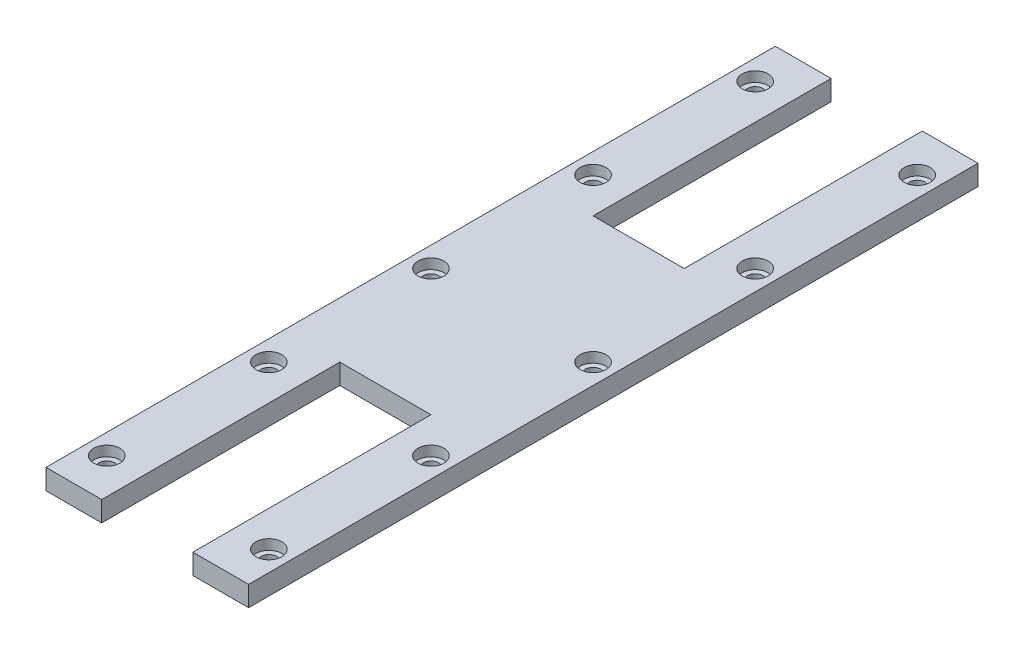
ISO-10303-21;
HEADER;
FILE_DESCRIPTION(('STEP AP214'),'2;1');
FILE_NAME('part.step','',(''),(''),'','','');
FILE_SCHEMA(('AUTOMOTIVE_DESIGN { 1 0 10303 214 1 1 1 1 }'));
ENDSEC;
DATA;
#1=APPLICATION_CONTEXT('core data for automotive mechanical design processes');
#2=APPLICATION_PROTOCOL_DEFINITION('international standard','automotive_design',2000,#1);
#3=PRODUCT_CONTEXT('',#1,'mechanical');
#4=PRODUCT('Part','Part','',(#3));
#5=PRODUCT_RELATED_PRODUCT_CATEGORY('part','',(#4));
#6=PRODUCT_DEFINITION_FORMATION('','',#4);
#7=PRODUCT_DEFINITION_CONTEXT('part definition',#1,'design');
#8=PRODUCT_DEFINITION('design','',#6,#7);
#9=PRODUCT_DEFINITION_SHAPE('','',#8);
#10=(LENGTH_UNIT() NAMED_UNIT(*) SI_UNIT(.MILLI.,.METRE.));
#11=(NAMED_UNIT(*) PLANE_ANGLE_UNIT() SI_UNIT($,.RADIAN.));
#12=(NAMED_UNIT(*) SI_UNIT($,.STERADIAN.) SOLID_ANGLE_UNIT());
#13=UNCERTAINTY_MEASURE_WITH_UNIT(LENGTH_MEASURE(1.E-05),#10,'distance_accuracy_value','');
#14=(GEOMETRIC_REPRESENTATION_CONTEXT(3) GLOBAL_UNCERTAINTY_ASSIGNED_CONTEXT((#13)) GLOBAL_UNIT_ASSIGNED_CONTEXT((#10,
#11,#12)) REPRESENTATION_CONTEXT('',''));
#15=CARTESIAN_POINT('',(0.,0.,0.));
#16=DIRECTION('',(0.,0.,1.));
#17=DIRECTION('',(1.,0.,0.));
#18=AXIS2_PLACEMENT_3D('',#15,#16,#17);
#19=CARTESIAN_POINT('',(6.35,0.,-165.1));
#20=DIRECTION('',(0.,1.,0.));
#21=DIRECTION('',(0.,0.,1.));
#22=AXIS2_PLACEMENT_3D('',#19,#20,#21);
#23=CYLINDRICAL_SURFACE('',#22,2.45744999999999);
#24=CARTESIAN_POINT('',(6.35,0.,-165.1));
#25=DIRECTION('',(0.,1.,0.));
#26=DIRECTION('',(0.,0.,1.));
#27=AXIS2_PLACEMENT_3D('',#24,#25,#26);
#28=CIRCLE('',#27,2.45744999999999);
#29=CARTESIAN_POINT('',(6.35,0.,-162.64255));
#30=VERTEX_POINT('',#29);
#31=EDGE_CURVE('E232',#30,#30,#28,.T.);
#32=ORIENTED_EDGE('',*,*,#31,.F.);
#33=EDGE_LOOP('',(#32));
#34=FACE_BOUND('',#33,.T.);
#35=CARTESIAN_POINT('',(6.35,3.175,-165.1));
#36=DIRECTION('',(0.,1.,0.));
#37=DIRECTION('',(0.,0.,1.));
#38=AXIS2_PLACEMENT_3D('',#35,#36,#37);
#39=CIRCLE('',#38,2.45744999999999);
#40=CARTESIAN_POINT('',(6.35,3.175,-162.64255));
#41=VERTEX_POINT('',#40);
#42=EDGE_CURVE('E37',#41,#41,#39,.F.);
#43=ORIENTED_EDGE('',*,*,#42,.F.);
#44=EDGE_LOOP('',(#43));
#45=FACE_BOUND('',#44,.T.);
#46=ADVANCED_FACE('F33',(#34,#45),#23,.F.);
#47=CARTESIAN_POINT('',(6.35,0.,-114.3));
#48=DIRECTION('',(0.,1.,0.));
#49=DIRECTION('',(0.,0.,1.));
#50=AXIS2_PLACEMENT_3D('',#47,#48,#49);
#51=CYLINDRICAL_SURFACE('',#50,2.45745);
#52=CARTESIAN_POINT('',(6.35,0.,-114.3));
#53=DIRECTION('',(0.,1.,0.));
#54=DIRECTION('',(0.,0.,1.));
#55=AXIS2_PLACEMENT_3D('',#52,#53,#54);
#56=CIRCLE('',#55,2.45745);
#57=CARTESIAN_POINT('',(6.35,0.,-111.84255));
#58=VERTEX_POINT('',#57);
#59=EDGE_CURVE('E235',#58,#58,#56,.T.);
#60=ORIENTED_EDGE('',*,*,#59,.F.);
#61=EDGE_LOOP('',(#60));
#62=FACE_BOUND('',#61,.T.);
#63=CARTESIAN_POINT('',(6.35,3.175,-114.3));
#64=DIRECTION('',(0.,1.,0.));
#65=DIRECTION('',(0.,0.,1.));
#66=AXIS2_PLACEMENT_3D('',#63,#64,#65);
#67=CIRCLE('',#66,2.45745);
#68=CARTESIAN_POINT('',(6.35,3.175,-111.84255));
#69=VERTEX_POINT('',#68);
#70=EDGE_CURVE('E201',#69,#69,#67,.F.);
#71=ORIENTED_EDGE('',*,*,#70,.F.);
#72=EDGE_LOOP('',(#71));
#73=FACE_BOUND('',#72,.T.);
#74=ADVANCED_FACE('F315',(#62,#73),#51,.F.);
#75=CARTESIAN_POINT('',(57.15,0.,-165.1));
#76=DIRECTION('',(0.,1.,0.));
#77=DIRECTION('',(0.,0.,1.));
#78=AXIS2_PLACEMENT_3D('',#75,#76,#77);
#79=CYLINDRICAL_SURFACE('',#78,2.45745);
#80=CARTESIAN_POINT('',(57.15,0.,-165.1));
#81=DIRECTION('',(0.,1.,0.));
#82=DIRECTION('',(0.,0.,1.));
#83=AXIS2_PLACEMENT_3D('',#80,#81,#82);
#84=CIRCLE('',#83,2.45745);
#85=CARTESIAN_POINT('',(57.15,0.,-162.64255));
#86=VERTEX_POINT('',#85);
#87=EDGE_CURVE('E238',#86,#86,#84,.T.);
#88=ORIENTED_EDGE('',*,*,#87,.F.);
#89=EDGE_LOOP('',(#88));
#90=FACE_BOUND('',#89,.T.);
#91=CARTESIAN_POINT('',(57.15,3.175,-165.1));
#92=DIRECTION('',(0.,1.,0.));
#93=DIRECTION('',(0.,0.,1.));
#94=AXIS2_PLACEMENT_3D('',#91,#92,#93);
#95=CIRCLE('',#94,2.45745);
#96=CARTESIAN_POINT('',(57.15,3.175,-162.64255));
#97=VERTEX_POINT('',#96);
#98=EDGE_CURVE('E199',#97,#97,#95,.F.);
#99=ORIENTED_EDGE('',*,*,#98,.F.);
#100=EDGE_LOOP('',(#99));
#101=FACE_BOUND('',#100,.T.);
#102=ADVANCED_FACE('F321',(#90,#101),#79,.F.);
#103=CARTESIAN_POINT('',(57.15,0.,-114.3));
#104=DIRECTION('',(0.,1.,0.));
#105=DIRECTION('',(0.,0.,1.));
#106=AXIS2_PLACEMENT_3D('',#103,#104,#105);
#107=CYLINDRICAL_SURFACE('',#106,2.45745);
#108=CARTESIAN_POINT('',(57.15,0.,-114.3));
#109=DIRECTION('',(0.,1.,0.));
#110=DIRECTION('',(0.,0.,1.));
#111=AXIS2_PLACEMENT_3D('',#108,#109,#110);
#112=CIRCLE('',#111,2.45745);
#113=CARTESIAN_POINT('',(57.15,0.,-111.84255));
#114=VERTEX_POINT('',#113);
#115=EDGE_CURVE('E229',#114,#114,#112,.T.);
#116=ORIENTED_EDGE('',*,*,#115,.F.);
#117=EDGE_LOOP('',(#116));
#118=FACE_BOUND('',#117,.T.);
#119=CARTESIAN_POINT('',(57.15,3.175,-114.3));
#120=DIRECTION('',(0.,1.,0.));
#121=DIRECTION('',(0.,0.,1.));
#122=AXIS2_PLACEMENT_3D('',#119,#120,#121);
#123=CIRCLE('',#122,2.45745);
#124=CARTESIAN_POINT('',(57.15,3.175,-111.84255));
#125=VERTEX_POINT('',#124);
#126=EDGE_CURVE('E196',#125,#125,#123,.F.);
#127=ORIENTED_EDGE('',*,*,#126,.F.);
#128=EDGE_LOOP('',(#127));
#129=FACE_BOUND('',#128,.T.);
#130=ADVANCED_FACE('F332',(#118,#129),#107,.F.);
#131=CARTESIAN_POINT('',(57.15,0.,-12.7));
#132=DIRECTION('',(0.,1.,0.));
#133=DIRECTION('',(0.,0.,1.));
#134=AXIS2_PLACEMENT_3D('',#131,#132,#133);
#135=CYLINDRICAL_SURFACE('',#134,2.45745);
#136=CARTESIAN_POINT('',(57.15,0.,-12.7));
#137=DIRECTION('',(0.,1.,0.));
#138=DIRECTION('',(0.,0.,1.));
#139=AXIS2_PLACEMENT_3D('',#136,#137,#138);
#140=CIRCLE('',#139,2.45745);
#141=CARTESIAN_POINT('',(57.15,0.,-10.24255));
#142=VERTEX_POINT('',#141);
#143=EDGE_CURVE('E178',#142,#142,#140,.T.);
#144=ORIENTED_EDGE('',*,*,#143,.F.);
#145=EDGE_LOOP('',(#144));
#146=FACE_BOUND('',#145,.T.);
#147=CARTESIAN_POINT('',(57.15,3.175,-12.7));
#148=DIRECTION('',(0.,1.,0.));
#149=DIRECTION('',(0.,0.,1.));
#150=AXIS2_PLACEMENT_3D('',#147,#148,#149);
#151=CIRCLE('',#150,2.45745);
#152=CARTESIAN_POINT('',(57.15,3.175,-10.24255));
#153=VERTEX_POINT('',#152);
#154=EDGE_CURVE('E193',#153,#153,#151,.F.);
#155=ORIENTED_EDGE('',*,*,#154,.F.);
#156=EDGE_LOOP('',(#155));
#157=FACE_BOUND('',#156,.T.);
#158=ADVANCED_FACE('F335',(#146,#157),#135,.F.);
#159=CARTESIAN_POINT('',(6.35,0.,-12.7));
#160=DIRECTION('',(0.,1.,0.));
#161=DIRECTION('',(0.,0.,1.));
#162=AXIS2_PLACEMENT_3D('',#159,#160,#161);
#163=CYLINDRICAL_SURFACE('',#162,2.45745);
#164=CARTESIAN_POINT('',(6.35,0.,-12.7));
#165=DIRECTION('',(0.,1.,0.));
#166=DIRECTION('',(0.,0.,1.));
#167=AXIS2_PLACEMENT_3D('',#164,#165,#166);
#168=CIRCLE('',#167,2.45745);
#169=CARTESIAN_POINT('',(6.35,0.,-10.24255));
#170=VERTEX_POINT('',#169);
#171=EDGE_CURVE('E221',#170,#170,#168,.T.);
#172=ORIENTED_EDGE('',*,*,#171,.F.);
#173=EDGE_LOOP('',(#172));
#174=FACE_BOUND('',#173,.T.);
#175=CARTESIAN_POINT('',(6.35,3.175,-12.7));
#176=DIRECTION('',(0.,1.,0.));
#177=DIRECTION('',(0.,0.,1.));
#178=AXIS2_PLACEMENT_3D('',#175,#176,#177);
#179=CIRCLE('',#178,2.45745);
#180=CARTESIAN_POINT('',(6.35,3.175,-10.24255));
#181=VERTEX_POINT('',#180);
#182=EDGE_CURVE('E190',#181,#181,#179,.F.);
#183=ORIENTED_EDGE('',*,*,#182,.F.);
#184=EDGE_LOOP('',(#183));
#185=FACE_BOUND('',#184,.T.);
#186=ADVANCED_FACE('F369',(#174,#185),#163,.F.);
#187=CARTESIAN_POINT('',(57.15,0.,-215.9));
#188=DIRECTION('',(0.,1.,0.));
#189=DIRECTION('',(0.,0.,1.));
#190=AXIS2_PLACEMENT_3D('',#187,#188,#189);
#191=CYLINDRICAL_SURFACE('',#190,2.45745);
#192=CARTESIAN_POINT('',(57.15,0.,-215.9));
#193=DIRECTION('',(0.,1.,0.));
#194=DIRECTION('',(0.,0.,1.));
#195=AXIS2_PLACEMENT_3D('',#192,#193,#194);
#196=CIRCLE('',#195,2.45745);
#197=CARTESIAN_POINT('',(57.15,0.,-213.44255));
#198=VERTEX_POINT('',#197);
#199=EDGE_CURVE('E217',#198,#198,#196,.T.);
#200=ORIENTED_EDGE('',*,*,#199,.F.);
#201=EDGE_LOOP('',(#200));
#202=FACE_BOUND('',#201,.T.);
#203=CARTESIAN_POINT('',(57.15,3.175,-215.9));
#204=DIRECTION('',(0.,1.,0.));
#205=DIRECTION('',(0.,0.,1.));
#206=AXIS2_PLACEMENT_3D('',#203,#204,#205);
#207=CIRCLE('',#206,2.45745);
#208=CARTESIAN_POINT('',(57.15,3.175,-213.44255));
#209=VERTEX_POINT('',#208);
#210=EDGE_CURVE('E187',#209,#209,#207,.F.);
#211=ORIENTED_EDGE('',*,*,#210,.F.);
#212=EDGE_LOOP('',(#211));
#213=FACE_BOUND('',#212,.T.);
#214=ADVANCED_FACE('F366',(#202,#213),#191,.F.);
#215=CARTESIAN_POINT('',(6.35,0.,-63.5));
#216=DIRECTION('',(0.,1.,0.));
#217=DIRECTION('',(0.,0.,1.));
#218=AXIS2_PLACEMENT_3D('',#215,#216,#217);
#219=CYLINDRICAL_SURFACE('',#218,2.45745);
#220=CARTESIAN_POINT('',(6.35,0.,-63.5));
#221=DIRECTION('',(0.,1.,0.));
#222=DIRECTION('',(0.,0.,1.));
#223=AXIS2_PLACEMENT_3D('',#220,#221,#222);
#224=CIRCLE('',#223,2.45745);
#225=CARTESIAN_POINT('',(6.35,0.,-61.04255));
#226=VERTEX_POINT('',#225);
#227=EDGE_CURVE('E220',#226,#226,#224,.T.);
#228=ORIENTED_EDGE('',*,*,#227,.F.);
#229=EDGE_LOOP('',(#228));
#230=FACE_BOUND('',#229,.T.);
#231=CARTESIAN_POINT('',(6.35,3.175,-63.5));
#232=DIRECTION('',(0.,1.,0.));
#233=DIRECTION('',(0.,0.,1.));
#234=AXIS2_PLACEMENT_3D('',#231,#232,#233);
#235=CIRCLE('',#234,2.45745);
#236=CARTESIAN_POINT('',(6.35,3.175,-61.04255));
#237=VERTEX_POINT('',#236);
#238=EDGE_CURVE('E183',#237,#237,#235,.F.);
#239=ORIENTED_EDGE('',*,*,#238,.F.);
#240=EDGE_LOOP('',(#239));
#241=FACE_BOUND('',#240,.T.);
#242=ADVANCED_FACE('F327',(#230,#241),#219,.F.);
#243=CARTESIAN_POINT('',(57.15,0.,-63.5));
#244=DIRECTION('',(0.,1.,0.));
#245=DIRECTION('',(0.,0.,1.));
#246=AXIS2_PLACEMENT_3D('',#243,#244,#245);
#247=CYLINDRICAL_SURFACE('',#246,2.45745);
#248=CARTESIAN_POINT('',(57.15,0.,-63.5));
#249=DIRECTION('',(0.,1.,0.));
#250=DIRECTION('',(0.,0.,1.));
#251=AXIS2_PLACEMENT_3D('',#248,#249,#250);
#252=CIRCLE('',#251,2.45745);
#253=CARTESIAN_POINT('',(57.15,0.,-61.04255));
#254=VERTEX_POINT('',#253);
#255=EDGE_CURVE('E226',#254,#254,#252,.T.);
#256=ORIENTED_EDGE('',*,*,#255,.F.);
#257=EDGE_LOOP('',(#256));
#258=FACE_BOUND('',#257,.T.);
#259=CARTESIAN_POINT('',(57.15,3.175,-63.5));
#260=DIRECTION('',(0.,1.,0.));
#261=DIRECTION('',(0.,0.,1.));
#262=AXIS2_PLACEMENT_3D('',#259,#260,#261);
#263=CIRCLE('',#262,2.45745);
#264=CARTESIAN_POINT('',(57.15,3.175,-61.04255));
#265=VERTEX_POINT('',#264);
#266=EDGE_CURVE('E180',#265,#265,#263,.F.);
#267=ORIENTED_EDGE('',*,*,#266,.F.);
#268=EDGE_LOOP('',(#267));
#269=FACE_BOUND('',#268,.T.);
#270=ADVANCED_FACE('F339',(#258,#269),#247,.F.);
#271=CARTESIAN_POINT('',(6.35,0.,-215.9));
#272=DIRECTION('',(0.,1.,0.));
#273=DIRECTION('',(0.,0.,1.));
#274=AXIS2_PLACEMENT_3D('',#271,#272,#273);
#275=CYLINDRICAL_SURFACE('',#274,2.45745);
#276=CARTESIAN_POINT('',(6.35,0.,-215.9));
#277=DIRECTION('',(0.,1.,0.));
#278=DIRECTION('',(0.,0.,1.));
#279=AXIS2_PLACEMENT_3D('',#276,#277,#278);
#280=CIRCLE('',#279,2.45745);
#281=CARTESIAN_POINT('',(6.35,0.,-213.44255));
#282=VERTEX_POINT('',#281);
#283=EDGE_CURVE('E134',#282,#282,#280,.T.);
#284=ORIENTED_EDGE('',*,*,#283,.F.);
#285=EDGE_LOOP('',(#284));
#286=FACE_BOUND('',#285,.T.);
#287=CARTESIAN_POINT('',(6.35,3.175,-215.9));
#288=DIRECTION('',(0.,1.,0.));
#289=DIRECTION('',(0.,0.,1.));
#290=AXIS2_PLACEMENT_3D('',#287,#288,#289);
#291=CIRCLE('',#290,2.45745);
#292=CARTESIAN_POINT('',(6.35,3.175,-213.44255));
#293=VERTEX_POINT('',#292);
#294=EDGE_CURVE('E175',#293,#293,#291,.F.);
#295=ORIENTED_EDGE('',*,*,#294,.F.);
#296=EDGE_LOOP('',(#295));
#297=FACE_BOUND('',#296,.T.);
#298=ADVANCED_FACE('F337',(#286,#297),#275,.F.);
#299=CARTESIAN_POINT('',(0.,0.,0.));
#300=DIRECTION('',(0.,0.,-1.));
#301=DIRECTION('',(-1.,0.,0.));
#302=AXIS2_PLACEMENT_3D('',#299,#300,#301);
#303=PLANE('',#302);
#304=DIRECTION('',(1.,0.,0.));
#305=VECTOR('',#304,1.);
#306=CARTESIAN_POINT('',(0.,0.,0.));
#307=LINE('',#306,#305);
#308=CARTESIAN_POINT('',(0.,0.,0.));
#309=VERTEX_POINT('',#308);
#310=CARTESIAN_POINT('',(17.4625,0.,0.));
#311=VERTEX_POINT('',#310);
#312=EDGE_CURVE('E143',#309,#311,#307,.T.);
#313=ORIENTED_EDGE('',*,*,#312,.T.);
#314=DIRECTION('',(0.,1.,0.));
#315=VECTOR('',#314,1.);
#316=CARTESIAN_POINT('',(17.4625,0.,0.));
#317=LINE('',#316,#315);
#318=CARTESIAN_POINT('',(17.4625,6.35,0.));
#319=VERTEX_POINT('',#318);
#320=EDGE_CURVE('E42',#311,#319,#317,.T.);
#321=ORIENTED_EDGE('',*,*,#320,.T.);
#322=DIRECTION('',(-1.,0.,0.));
#323=VECTOR('',#322,1.);
#324=CARTESIAN_POINT('',(0.,6.35,0.));
#325=LINE('',#324,#323);
#326=CARTESIAN_POINT('',(0.,6.35,0.));
#327=VERTEX_POINT('',#326);
#328=EDGE_CURVE('E140',#319,#327,#325,.T.);
#329=ORIENTED_EDGE('',*,*,#328,.T.);
#330=DIRECTION('',(0.,-1.,0.));
#331=VECTOR('',#330,1.);
#332=CARTESIAN_POINT('',(0.,0.,0.));
#333=LINE('',#332,#331);
#334=EDGE_CURVE('E270',#327,#309,#333,.T.);
#335=ORIENTED_EDGE('',*,*,#334,.T.);
#336=EDGE_LOOP('',(#313,#321,#329,#335));
#337=FACE_BOUND('',#336,.T.);
#338=ADVANCED_FACE('F138',(#337),#303,.F.);
#339=CARTESIAN_POINT('',(0.,0.,-228.6));
#340=DIRECTION('',(0.,0.,-1.));
#341=DIRECTION('',(-1.,0.,0.));
#342=AXIS2_PLACEMENT_3D('',#339,#340,#341);
#343=PLANE('',#342);
#344=DIRECTION('',(0.,1.,0.));
#345=VECTOR('',#344,1.);
#346=CARTESIAN_POINT('',(17.4625,0.,-228.6));
#347=LINE('',#346,#345);
#348=CARTESIAN_POINT('',(17.4625,0.,-228.6));
#349=VERTEX_POINT('',#348);
#350=CARTESIAN_POINT('',(17.4625,6.35,-228.6));
#351=VERTEX_POINT('',#350);
#352=EDGE_CURVE('E170',#349,#351,#347,.T.);
#353=ORIENTED_EDGE('',*,*,#352,.F.);
#354=DIRECTION('',(1.,0.,0.));
#355=VECTOR('',#354,1.);
#356=CARTESIAN_POINT('',(0.,0.,-228.6));
#357=LINE('',#356,#355);
#358=CARTESIAN_POINT('',(0.,0.,-228.6));
#359=VERTEX_POINT('',#358);
#360=EDGE_CURVE('E274',#359,#349,#357,.T.);
#361=ORIENTED_EDGE('',*,*,#360,.F.);
#362=DIRECTION('',(0.,-1.,0.));
#363=VECTOR('',#362,1.);
#364=CARTESIAN_POINT('',(0.,0.,-228.6));
#365=LINE('',#364,#363);
#366=CARTESIAN_POINT('',(0.,6.35,-228.6));
#367=VERTEX_POINT('',#366);
#368=EDGE_CURVE('E154',#367,#359,#365,.T.);
#369=ORIENTED_EDGE('',*,*,#368,.F.);
#370=DIRECTION('',(-1.,0.,0.));
#371=VECTOR('',#370,1.);
#372=CARTESIAN_POINT('',(0.,6.35,-228.6));
#373=LINE('',#372,#371);
#374=EDGE_CURVE('E280',#351,#367,#373,.T.);
#375=ORIENTED_EDGE('',*,*,#374,.F.);
#376=EDGE_LOOP('',(#353,#361,#369,#375));
#377=FACE_BOUND('',#376,.T.);
#378=ADVANCED_FACE('F345',(#377),#343,.T.);
#379=CARTESIAN_POINT('',(0.,0.,-228.6));
#380=DIRECTION('',(-1.,0.,0.));
#381=DIRECTION('',(0.,0.,1.));
#382=AXIS2_PLACEMENT_3D('',#379,#380,#381);
#383=PLANE('',#382);
#384=ORIENTED_EDGE('',*,*,#334,.F.);
#385=DIRECTION('',(0.,0.,1.));
#386=VECTOR('',#385,1.);
#387=CARTESIAN_POINT('',(0.,6.35,-228.6));
#388=LINE('',#387,#386);
#389=EDGE_CURVE('E148',#367,#327,#388,.T.);
#390=ORIENTED_EDGE('',*,*,#389,.F.);
#391=ORIENTED_EDGE('',*,*,#368,.T.);
#392=DIRECTION('',(0.,0.,1.));
#393=VECTOR('',#392,1.);
#394=CARTESIAN_POINT('',(0.,0.,-228.6));
#395=LINE('',#394,#393);
#396=EDGE_CURVE('E166',#359,#309,#395,.T.);
#397=ORIENTED_EDGE('',*,*,#396,.T.);
#398=EDGE_LOOP('',(#384,#390,#391,#397));
#399=FACE_BOUND('',#398,.T.);
#400=ADVANCED_FACE('F35',(#399),#383,.T.);
#401=CARTESIAN_POINT('',(0.,6.35,-228.6));
#402=DIRECTION('',(0.,1.,0.));
#403=DIRECTION('',(0.,0.,1.));
#404=AXIS2_PLACEMENT_3D('',#401,#402,#403);
#405=PLANE('',#404);
#406=CARTESIAN_POINT('',(57.15,6.35,-165.1));
#407=DIRECTION('',(0.,1.,0.));
#408=DIRECTION('',(0.,0.,1.));
#409=AXIS2_PLACEMENT_3D('',#406,#407,#408);
#410=CIRCLE('',#409,4.06400000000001);
#411=CARTESIAN_POINT('',(57.15,6.35,-161.036));
#412=VERTEX_POINT('',#411);
#413=EDGE_CURVE('E481',#412,#412,#410,.T.);
#414=ORIENTED_EDGE('',*,*,#413,.F.);
#415=EDGE_LOOP('',(#414));
#416=FACE_BOUND('',#415,.T.);
#417=CARTESIAN_POINT('',(6.35,6.35,-63.5));
#418=DIRECTION('',(0.,1.,0.));
#419=DIRECTION('',(0.,0.,1.));
#420=AXIS2_PLACEMENT_3D('',#417,#418,#419);
#421=CIRCLE('',#420,4.064);
#422=CARTESIAN_POINT('',(6.35,6.35,-59.436));
#423=VERTEX_POINT('',#422);
#424=EDGE_CURVE('E474',#423,#423,#421,.T.);
#425=ORIENTED_EDGE('',*,*,#424,.F.);
#426=EDGE_LOOP('',(#425));
#427=FACE_BOUND('',#426,.T.);
#428=CARTESIAN_POINT('',(6.35,6.35,-12.7));
#429=DIRECTION('',(0.,1.,0.));
#430=DIRECTION('',(0.,0.,1.));
#431=AXIS2_PLACEMENT_3D('',#428,#429,#430);
#432=CIRCLE('',#431,4.064);
#433=CARTESIAN_POINT('',(6.35,6.35,-8.63599999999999));
#434=VERTEX_POINT('',#433);
#435=EDGE_CURVE('E491',#434,#434,#432,.T.);
#436=ORIENTED_EDGE('',*,*,#435,.F.);
#437=EDGE_LOOP('',(#436));
#438=FACE_BOUND('',#437,.T.);
#439=CARTESIAN_POINT('',(57.15,6.35,-215.9));
#440=DIRECTION('',(0.,1.,0.));
#441=DIRECTION('',(0.,0.,1.));
#442=AXIS2_PLACEMENT_3D('',#439,#440,#441);
#443=CIRCLE('',#442,4.06400000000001);
#444=CARTESIAN_POINT('',(57.15,6.35,-211.836));
#445=VERTEX_POINT('',#444);
#446=EDGE_CURVE('E497',#445,#445,#443,.T.);
#447=ORIENTED_EDGE('',*,*,#446,.F.);
#448=EDGE_LOOP('',(#447));
#449=FACE_BOUND('',#448,.T.);
#450=CARTESIAN_POINT('',(57.15,6.35,-12.7));
#451=DIRECTION('',(0.,1.,0.));
#452=DIRECTION('',(0.,0.,1.));
#453=AXIS2_PLACEMENT_3D('',#450,#451,#452);
#454=CIRCLE('',#453,4.064);
#455=CARTESIAN_POINT('',(57.15,6.35,-8.636));
#456=VERTEX_POINT('',#455);
#457=EDGE_CURVE('E486',#456,#456,#454,.T.);
#458=ORIENTED_EDGE('',*,*,#457,.F.);
#459=EDGE_LOOP('',(#458));
#460=FACE_BOUND('',#459,.T.);
#461=CARTESIAN_POINT('',(57.15,6.35,-114.3));
#462=DIRECTION('',(0.,1.,0.));
#463=DIRECTION('',(0.,0.,1.));
#464=AXIS2_PLACEMENT_3D('',#461,#462,#463);
#465=CIRCLE('',#464,4.064);
#466=CARTESIAN_POINT('',(57.15,6.35,-110.236));
#467=VERTEX_POINT('',#466);
#468=EDGE_CURVE('E453',#467,#467,#465,.T.);
#469=ORIENTED_EDGE('',*,*,#468,.F.);
#470=EDGE_LOOP('',(#469));
#471=FACE_BOUND('',#470,.T.);
#472=CARTESIAN_POINT('',(57.15,6.35,-63.5));
#473=DIRECTION('',(0.,1.,0.));
#474=DIRECTION('',(0.,0.,1.));
#475=AXIS2_PLACEMENT_3D('',#472,#473,#474);
#476=CIRCLE('',#475,4.064);
#477=CARTESIAN_POINT('',(57.15,6.35,-59.436));
#478=VERTEX_POINT('',#477);
#479=EDGE_CURVE('E452',#478,#478,#476,.T.);
#480=ORIENTED_EDGE('',*,*,#479,.F.);
#481=EDGE_LOOP('',(#480));
#482=FACE_BOUND('',#481,.T.);
#483=CARTESIAN_POINT('',(6.35,6.35,-114.3));
#484=DIRECTION('',(0.,1.,0.));
#485=DIRECTION('',(0.,0.,1.));
#486=AXIS2_PLACEMENT_3D('',#483,#484,#485);
#487=CIRCLE('',#486,4.06399999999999);
#488=CARTESIAN_POINT('',(6.35,6.35,-110.236));
#489=VERTEX_POINT('',#488);
#490=EDGE_CURVE('E463',#489,#489,#487,.T.);
#491=ORIENTED_EDGE('',*,*,#490,.F.);
#492=EDGE_LOOP('',(#491));
#493=FACE_BOUND('',#492,.T.);
#494=CARTESIAN_POINT('',(6.35,6.35,-165.1));
#495=DIRECTION('',(0.,1.,0.));
#496=DIRECTION('',(0.,0.,1.));
#497=AXIS2_PLACEMENT_3D('',#494,#495,#496);
#498=CIRCLE('',#497,4.064);
#499=CARTESIAN_POINT('',(6.35,6.35,-161.036));
#500=VERTEX_POINT('',#499);
#501=EDGE_CURVE('E469',#500,#500,#498,.T.);
#502=ORIENTED_EDGE('',*,*,#501,.F.);
#503=EDGE_LOOP('',(#502));
#504=FACE_BOUND('',#503,.T.);
#505=CARTESIAN_POINT('',(6.35,6.35,-215.9));
#506=DIRECTION('',(0.,1.,0.));
#507=DIRECTION('',(0.,0.,1.));
#508=AXIS2_PLACEMENT_3D('',#505,#506,#507);
#509=CIRCLE('',#508,4.06400000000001);
#510=CARTESIAN_POINT('',(6.35,6.35,-211.836));
#511=VERTEX_POINT('',#510);
#512=EDGE_CURVE('E206',#511,#511,#509,.T.);
#513=ORIENTED_EDGE('',*,*,#512,.F.);
#514=EDGE_LOOP('',(#513));
#515=FACE_BOUND('',#514,.T.);
#516=DIRECTION('',(0.,0.,1.));
#517=VECTOR('',#516,1.);
#518=CARTESIAN_POINT('',(17.4625,6.35,0.));
#519=LINE('',#518,#517);
#520=CARTESIAN_POINT('',(17.4625,6.35,-74.6125));
#521=VERTEX_POINT('',#520);
#522=EDGE_CURVE('E123',#521,#319,#519,.T.);
#523=ORIENTED_EDGE('',*,*,#522,.F.);
#524=DIRECTION('',(-1.,0.,0.));
#525=VECTOR('',#524,1.);
#526=CARTESIAN_POINT('',(17.4625,6.35,-74.6125));
#527=LINE('',#526,#525);
#528=CARTESIAN_POINT('',(46.0375,6.35,-74.6125));
#529=VERTEX_POINT('',#528);
#530=EDGE_CURVE('E247',#529,#521,#527,.T.);
#531=ORIENTED_EDGE('',*,*,#530,.F.);
#532=DIRECTION('',(0.,0.,-1.));
#533=VECTOR('',#532,1.);
#534=CARTESIAN_POINT('',(46.0375,6.35,0.));
#535=LINE('',#534,#533);
#536=CARTESIAN_POINT('',(46.0375,6.35,0.));
#537=VERTEX_POINT('',#536);
#538=EDGE_CURVE('E133',#537,#529,#535,.T.);
#539=ORIENTED_EDGE('',*,*,#538,.F.);
#540=CARTESIAN_POINT('',(63.5,6.35,0.));
#541=VERTEX_POINT('',#540);
#542=EDGE_CURVE('E150',#541,#537,#325,.T.);
#543=ORIENTED_EDGE('',*,*,#542,.F.);
#544=DIRECTION('',(0.,0.,1.));
#545=VECTOR('',#544,1.);
#546=CARTESIAN_POINT('',(63.5,6.35,-228.6));
#547=LINE('',#546,#545);
#548=CARTESIAN_POINT('',(63.5,6.35,-228.6));
#549=VERTEX_POINT('',#548);
#550=EDGE_CURVE('E161',#549,#541,#547,.T.);
#551=ORIENTED_EDGE('',*,*,#550,.F.);
#552=CARTESIAN_POINT('',(46.0375,6.35,-228.6));
#553=VERTEX_POINT('',#552);
#554=EDGE_CURVE('E168',#549,#553,#373,.T.);
#555=ORIENTED_EDGE('',*,*,#554,.T.);
#556=DIRECTION('',(0.,0.,-1.));
#557=VECTOR('',#556,1.);
#558=CARTESIAN_POINT('',(46.0375,6.35,-228.6));
#559=LINE('',#558,#557);
#560=CARTESIAN_POINT('',(46.0375,6.35,-153.9875));
#561=VERTEX_POINT('',#560);
#562=EDGE_CURVE('E58',#561,#553,#559,.T.);
#563=ORIENTED_EDGE('',*,*,#562,.F.);
#564=DIRECTION('',(1.,0.,0.));
#565=VECTOR('',#564,1.);
#566=CARTESIAN_POINT('',(17.4625,6.35,-153.9875));
#567=LINE('',#566,#565);
#568=CARTESIAN_POINT('',(17.4625,6.35,-153.9875));
#569=VERTEX_POINT('',#568);
#570=EDGE_CURVE('E258',#569,#561,#567,.T.);
#571=ORIENTED_EDGE('',*,*,#570,.F.);
#572=DIRECTION('',(0.,0.,1.));
#573=VECTOR('',#572,1.);
#574=CARTESIAN_POINT('',(17.4625,6.35,-228.6));
#575=LINE('',#574,#573);
#576=EDGE_CURVE('E255',#351,#569,#575,.T.);
#577=ORIENTED_EDGE('',*,*,#576,.F.);
#578=ORIENTED_EDGE('',*,*,#374,.T.);
#579=ORIENTED_EDGE('',*,*,#389,.T.);
#580=ORIENTED_EDGE('',*,*,#328,.F.);
#581=EDGE_LOOP('',(#523,#531,#539,#543,#551,#555,#563,#571,#577,#578,#579,#580));
#582=FACE_BOUND('',#581,.T.);
#583=ADVANCED_FACE('F146',(#416,#427,#438,#449,#460,#471,#482,#493,#504,#515,#582),#405,.T.);
#584=CARTESIAN_POINT('',(63.5,0.,-228.6));
#585=DIRECTION('',(1.,0.,0.));
#586=DIRECTION('',(0.,0.,-1.));
#587=AXIS2_PLACEMENT_3D('',#584,#585,#586);
#588=PLANE('',#587);
#589=DIRECTION('',(0.,1.,0.));
#590=VECTOR('',#589,1.);
#591=CARTESIAN_POINT('',(63.5,0.,0.));
#592=LINE('',#591,#590);
#593=CARTESIAN_POINT('',(63.5,0.,0.));
#594=VERTEX_POINT('',#593);
#595=EDGE_CURVE('E151',#594,#541,#592,.T.);
#596=ORIENTED_EDGE('',*,*,#595,.F.);
#597=DIRECTION('',(0.,0.,1.));
#598=VECTOR('',#597,1.);
#599=CARTESIAN_POINT('',(63.5,0.,-228.6));
#600=LINE('',#599,#598);
#601=CARTESIAN_POINT('',(63.5,0.,-228.6));
#602=VERTEX_POINT('',#601);
#603=EDGE_CURVE('E163',#602,#594,#600,.T.);
#604=ORIENTED_EDGE('',*,*,#603,.F.);
#605=DIRECTION('',(0.,1.,0.));
#606=VECTOR('',#605,1.);
#607=CARTESIAN_POINT('',(63.5,0.,-228.6));
#608=LINE('',#607,#606);
#609=EDGE_CURVE('E277',#602,#549,#608,.T.);
#610=ORIENTED_EDGE('',*,*,#609,.T.);
#611=ORIENTED_EDGE('',*,*,#550,.T.);
#612=EDGE_LOOP('',(#596,#604,#610,#611));
#613=FACE_BOUND('',#612,.T.);
#614=ADVANCED_FACE('F296',(#613),#588,.T.);
#615=CARTESIAN_POINT('',(0.,0.,-228.6));
#616=DIRECTION('',(0.,-1.,0.));
#617=DIRECTION('',(0.,0.,-1.));
#618=AXIS2_PLACEMENT_3D('',#615,#616,#617);
#619=PLANE('',#618);
#620=ORIENTED_EDGE('',*,*,#255,.T.);
#621=EDGE_LOOP('',(#620));
#622=FACE_BOUND('',#621,.T.);
#623=ORIENTED_EDGE('',*,*,#227,.T.);
#624=EDGE_LOOP('',(#623));
#625=FACE_BOUND('',#624,.T.);
#626=ORIENTED_EDGE('',*,*,#199,.T.);
#627=EDGE_LOOP('',(#626));
#628=FACE_BOUND('',#627,.T.);
#629=ORIENTED_EDGE('',*,*,#171,.T.);
#630=EDGE_LOOP('',(#629));
#631=FACE_BOUND('',#630,.T.);
#632=ORIENTED_EDGE('',*,*,#143,.T.);
#633=EDGE_LOOP('',(#632));
#634=FACE_BOUND('',#633,.T.);
#635=ORIENTED_EDGE('',*,*,#115,.T.);
#636=EDGE_LOOP('',(#635));
#637=FACE_BOUND('',#636,.T.);
#638=ORIENTED_EDGE('',*,*,#87,.T.);
#639=EDGE_LOOP('',(#638));
#640=FACE_BOUND('',#639,.T.);
#641=ORIENTED_EDGE('',*,*,#59,.T.);
#642=EDGE_LOOP('',(#641));
#643=FACE_BOUND('',#642,.T.);
#644=ORIENTED_EDGE('',*,*,#31,.T.);
#645=EDGE_LOOP('',(#644));
#646=FACE_BOUND('',#645,.T.);
#647=ORIENTED_EDGE('',*,*,#283,.T.);
#648=EDGE_LOOP('',(#647));
#649=FACE_BOUND('',#648,.T.);
#650=DIRECTION('',(0.,0.,-1.));
#651=VECTOR('',#650,1.);
#652=CARTESIAN_POINT('',(17.4625,0.,-228.6));
#653=LINE('',#652,#651);
#654=CARTESIAN_POINT('',(17.4625,0.,-74.6125));
#655=VERTEX_POINT('',#654);
#656=EDGE_CURVE('E253',#311,#655,#653,.T.);
#657=ORIENTED_EDGE('',*,*,#656,.F.);
#658=ORIENTED_EDGE('',*,*,#312,.F.);
#659=ORIENTED_EDGE('',*,*,#396,.F.);
#660=ORIENTED_EDGE('',*,*,#360,.T.);
#661=DIRECTION('',(0.,0.,-1.));
#662=VECTOR('',#661,1.);
#663=CARTESIAN_POINT('',(17.4625,0.,-228.6));
#664=LINE('',#663,#662);
#665=CARTESIAN_POINT('',(17.4625,0.,-153.9875));
#666=VERTEX_POINT('',#665);
#667=EDGE_CURVE('E268',#666,#349,#664,.T.);
#668=ORIENTED_EDGE('',*,*,#667,.F.);
#669=DIRECTION('',(-1.,0.,0.));
#670=VECTOR('',#669,1.);
#671=CARTESIAN_POINT('',(0.,0.,-153.9875));
#672=LINE('',#671,#670);
#673=CARTESIAN_POINT('',(46.0375,0.,-153.9875));
#674=VERTEX_POINT('',#673);
#675=EDGE_CURVE('E172',#674,#666,#672,.T.);
#676=ORIENTED_EDGE('',*,*,#675,.F.);
#677=DIRECTION('',(0.,0.,1.));
#678=VECTOR('',#677,1.);
#679=CARTESIAN_POINT('',(46.0375,0.,-228.6));
#680=LINE('',#679,#678);
#681=CARTESIAN_POINT('',(46.0375,0.,-228.6));
#682=VERTEX_POINT('',#681);
#683=EDGE_CURVE('E265',#682,#674,#680,.T.);
#684=ORIENTED_EDGE('',*,*,#683,.F.);
#685=EDGE_CURVE('E273',#682,#602,#357,.T.);
#686=ORIENTED_EDGE('',*,*,#685,.T.);
#687=ORIENTED_EDGE('',*,*,#603,.T.);
#688=CARTESIAN_POINT('',(46.0375,0.,0.));
#689=VERTEX_POINT('',#688);
#690=EDGE_CURVE('E283',#689,#594,#307,.T.);
#691=ORIENTED_EDGE('',*,*,#690,.F.);
#692=DIRECTION('',(0.,0.,1.));
#693=VECTOR('',#692,1.);
#694=CARTESIAN_POINT('',(46.0375,0.,-228.6));
#695=LINE('',#694,#693);
#696=CARTESIAN_POINT('',(46.0375,0.,-74.6125));
#697=VERTEX_POINT('',#696);
#698=EDGE_CURVE('E50',#697,#689,#695,.T.);
#699=ORIENTED_EDGE('',*,*,#698,.F.);
#700=DIRECTION('',(1.,0.,0.));
#701=VECTOR('',#700,1.);
#702=CARTESIAN_POINT('',(0.,0.,-74.6125));
#703=LINE('',#702,#701);
#704=EDGE_CURVE('E11',#655,#697,#703,.T.);
#705=ORIENTED_EDGE('',*,*,#704,.F.);
#706=EDGE_LOOP('',(#657,#658,#659,#660,#668,#676,#684,#686,#687,#691,#699,#705));
#707=FACE_BOUND('',#706,.T.);
#708=ADVANCED_FACE('F291',(#622,#625,#628,#631,#634,#637,#640,#643,#646,#649,#707),#619,.T.);
#709=DIRECTION('',(0.,-1.,0.));
#710=VECTOR('',#709,1.);
#711=CARTESIAN_POINT('',(46.0375,0.,-228.6));
#712=LINE('',#711,#710);
#713=EDGE_CURVE('E160',#553,#682,#712,.T.);
#714=ORIENTED_EDGE('',*,*,#713,.F.);
#715=ORIENTED_EDGE('',*,*,#554,.F.);
#716=ORIENTED_EDGE('',*,*,#609,.F.);
#717=ORIENTED_EDGE('',*,*,#685,.F.);
#718=EDGE_LOOP('',(#714,#715,#716,#717));
#719=FACE_BOUND('',#718,.T.);
#720=ADVANCED_FACE('F540',(#719),#343,.T.);
#721=ORIENTED_EDGE('',*,*,#542,.T.);
#722=DIRECTION('',(0.,-1.,0.));
#723=VECTOR('',#722,1.);
#724=CARTESIAN_POINT('',(46.0375,0.,0.));
#725=LINE('',#724,#723);
#726=EDGE_CURVE('E144',#537,#689,#725,.T.);
#727=ORIENTED_EDGE('',*,*,#726,.T.);
#728=ORIENTED_EDGE('',*,*,#690,.T.);
#729=ORIENTED_EDGE('',*,*,#595,.T.);
#730=EDGE_LOOP('',(#721,#727,#728,#729));
#731=FACE_BOUND('',#730,.T.);
#732=ADVANCED_FACE('F286',(#731),#303,.F.);
#733=CARTESIAN_POINT('',(17.4625,-120.65,-228.6));
#734=DIRECTION('',(-1.,0.,0.));
#735=DIRECTION('',(0.,0.,1.));
#736=AXIS2_PLACEMENT_3D('',#733,#734,#735);
#737=PLANE('',#736);
#738=ORIENTED_EDGE('',*,*,#667,.T.);
#739=ORIENTED_EDGE('',*,*,#352,.T.);
#740=ORIENTED_EDGE('',*,*,#576,.T.);
#741=DIRECTION('',(0.,1.,0.));
#742=VECTOR('',#741,1.);
#743=CARTESIAN_POINT('',(17.4625,-120.65,-153.9875));
#744=LINE('',#743,#742);
#745=EDGE_CURVE('E262',#666,#569,#744,.T.);
#746=ORIENTED_EDGE('',*,*,#745,.F.);
#747=EDGE_LOOP('',(#738,#739,#740,#746));
#748=FACE_BOUND('',#747,.T.);
#749=ADVANCED_FACE('F761',(#748),#737,.F.);
#750=CARTESIAN_POINT('',(46.0375,-120.65,-228.6));
#751=DIRECTION('',(1.,0.,0.));
#752=DIRECTION('',(0.,0.,-1.));
#753=AXIS2_PLACEMENT_3D('',#750,#751,#752);
#754=PLANE('',#753);
#755=ORIENTED_EDGE('',*,*,#683,.T.);
#756=DIRECTION('',(0.,1.,0.));
#757=VECTOR('',#756,1.);
#758=CARTESIAN_POINT('',(46.0375,-120.65,-153.9875));
#759=LINE('',#758,#757);
#760=EDGE_CURVE('E263',#674,#561,#759,.T.);
#761=ORIENTED_EDGE('',*,*,#760,.T.);
#762=ORIENTED_EDGE('',*,*,#562,.T.);
#763=ORIENTED_EDGE('',*,*,#713,.T.);
#764=EDGE_LOOP('',(#755,#761,#762,#763));
#765=FACE_BOUND('',#764,.T.);
#766=ADVANCED_FACE('F752',(#765),#754,.F.);
#767=CARTESIAN_POINT('',(17.4625,-120.65,-153.9875));
#768=DIRECTION('',(0.,0.,1.));
#769=DIRECTION('',(1.,0.,0.));
#770=AXIS2_PLACEMENT_3D('',#767,#768,#769);
#771=PLANE('',#770);
#772=ORIENTED_EDGE('',*,*,#675,.T.);
#773=ORIENTED_EDGE('',*,*,#745,.T.);
#774=ORIENTED_EDGE('',*,*,#570,.T.);
#775=ORIENTED_EDGE('',*,*,#760,.F.);
#776=EDGE_LOOP('',(#772,#773,#774,#775));
#777=FACE_BOUND('',#776,.T.);
#778=ADVANCED_FACE('F311',(#777),#771,.F.);
#779=CARTESIAN_POINT('',(17.4625,-120.65,0.));
#780=DIRECTION('',(-1.,0.,0.));
#781=DIRECTION('',(0.,0.,1.));
#782=AXIS2_PLACEMENT_3D('',#779,#780,#781);
#783=PLANE('',#782);
#784=ORIENTED_EDGE('',*,*,#656,.T.);
#785=DIRECTION('',(0.,1.,0.));
#786=VECTOR('',#785,1.);
#787=CARTESIAN_POINT('',(17.4625,-120.65,-74.6125));
#788=LINE('',#787,#786);
#789=EDGE_CURVE('E128',#655,#521,#788,.T.);
#790=ORIENTED_EDGE('',*,*,#789,.T.);
#791=ORIENTED_EDGE('',*,*,#522,.T.);
#792=ORIENTED_EDGE('',*,*,#320,.F.);
#793=EDGE_LOOP('',(#784,#790,#791,#792));
#794=FACE_BOUND('',#793,.T.);
#795=ADVANCED_FACE('F125',(#794),#783,.F.);
#796=CARTESIAN_POINT('',(17.4625,-120.65,-74.6125));
#797=DIRECTION('',(0.,0.,-1.));
#798=DIRECTION('',(-1.,0.,0.));
#799=AXIS2_PLACEMENT_3D('',#796,#797,#798);
#800=PLANE('',#799);
#801=ORIENTED_EDGE('',*,*,#704,.T.);
#802=DIRECTION('',(0.,1.,0.));
#803=VECTOR('',#802,1.);
#804=CARTESIAN_POINT('',(46.0375,-120.65,-74.6125));
#805=LINE('',#804,#803);
#806=EDGE_CURVE('E249',#697,#529,#805,.T.);
#807=ORIENTED_EDGE('',*,*,#806,.T.);
#808=ORIENTED_EDGE('',*,*,#530,.T.);
#809=ORIENTED_EDGE('',*,*,#789,.F.);
#810=EDGE_LOOP('',(#801,#807,#808,#809));
#811=FACE_BOUND('',#810,.T.);
#812=ADVANCED_FACE('F302',(#811),#800,.F.);
#813=CARTESIAN_POINT('',(46.0375,-120.65,0.));
#814=DIRECTION('',(1.,0.,0.));
#815=DIRECTION('',(0.,0.,-1.));
#816=AXIS2_PLACEMENT_3D('',#813,#814,#815);
#817=PLANE('',#816);
#818=ORIENTED_EDGE('',*,*,#698,.T.);
#819=ORIENTED_EDGE('',*,*,#726,.F.);
#820=ORIENTED_EDGE('',*,*,#538,.T.);
#821=ORIENTED_EDGE('',*,*,#806,.F.);
#822=EDGE_LOOP('',(#818,#819,#820,#821));
#823=FACE_BOUND('',#822,.T.);
#824=ADVANCED_FACE('F299',(#823),#817,.F.);
#825=CARTESIAN_POINT('',(6.35,3.175,-215.9));
#826=DIRECTION('',(0.,1.,0.));
#827=DIRECTION('',(0.,0.,1.));
#828=AXIS2_PLACEMENT_3D('',#825,#826,#827);
#829=PLANE('',#828);
#830=CARTESIAN_POINT('',(6.35,3.175,-215.9));
#831=DIRECTION('',(0.,1.,0.));
#832=DIRECTION('',(0.,0.,1.));
#833=AXIS2_PLACEMENT_3D('',#830,#831,#832);
#834=CIRCLE('',#833,4.06400000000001);
#835=CARTESIAN_POINT('',(6.35,3.175,-211.836));
#836=VERTEX_POINT('',#835);
#837=EDGE_CURVE('E179',#836,#836,#834,.T.);
#838=ORIENTED_EDGE('',*,*,#837,.T.);
#839=EDGE_LOOP('',(#838));
#840=FACE_BOUND('',#839,.T.);
#841=ORIENTED_EDGE('',*,*,#294,.T.);
#842=EDGE_LOOP('',(#841));
#843=FACE_BOUND('',#842,.T.);
#844=ADVANCED_FACE('F309',(#840,#843),#829,.T.);
#845=CARTESIAN_POINT('',(6.35,3.175,-215.9));
#846=DIRECTION('',(0.,1.,0.));
#847=DIRECTION('',(0.,0.,1.));
#848=AXIS2_PLACEMENT_3D('',#845,#846,#847);
#849=CYLINDRICAL_SURFACE('',#848,4.06400000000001);
#850=ORIENTED_EDGE('',*,*,#837,.F.);
#851=EDGE_LOOP('',(#850));
#852=FACE_BOUND('',#851,.T.);
#853=ORIENTED_EDGE('',*,*,#512,.T.);
#854=EDGE_LOOP('',(#853));
#855=FACE_BOUND('',#854,.T.);
#856=ADVANCED_FACE('F353',(#852,#855),#849,.F.);
#857=CARTESIAN_POINT('',(57.15,3.175,-63.5));
#858=DIRECTION('',(0.,1.,0.));
#859=DIRECTION('',(0.,0.,1.));
#860=AXIS2_PLACEMENT_3D('',#857,#858,#859);
#861=PLANE('',#860);
#862=CARTESIAN_POINT('',(57.15,3.175,-63.5));
#863=DIRECTION('',(0.,1.,0.));
#864=DIRECTION('',(0.,0.,1.));
#865=AXIS2_PLACEMENT_3D('',#862,#863,#864);
#866=CIRCLE('',#865,4.064);
#867=CARTESIAN_POINT('',(57.15,3.175,-59.436));
#868=VERTEX_POINT('',#867);
#869=EDGE_CURVE('E456',#868,#868,#866,.T.);
#870=ORIENTED_EDGE('',*,*,#869,.T.);
#871=EDGE_LOOP('',(#870));
#872=FACE_BOUND('',#871,.T.);
#873=ORIENTED_EDGE('',*,*,#266,.T.);
#874=EDGE_LOOP('',(#873));
#875=FACE_BOUND('',#874,.T.);
#876=ADVANCED_FACE('F359',(#872,#875),#861,.T.);
#877=CARTESIAN_POINT('',(57.15,3.175,-63.5));
#878=DIRECTION('',(0.,1.,0.));
#879=DIRECTION('',(0.,0.,1.));
#880=AXIS2_PLACEMENT_3D('',#877,#878,#879);
#881=CYLINDRICAL_SURFACE('',#880,4.064);
#882=ORIENTED_EDGE('',*,*,#869,.F.);
#883=EDGE_LOOP('',(#882));
#884=FACE_BOUND('',#883,.T.);
#885=ORIENTED_EDGE('',*,*,#479,.T.);
#886=EDGE_LOOP('',(#885));
#887=FACE_BOUND('',#886,.T.);
#888=ADVANCED_FACE('F414',(#884,#887),#881,.F.);
#889=CARTESIAN_POINT('',(6.35,3.175,-63.5));
#890=DIRECTION('',(0.,1.,0.));
#891=DIRECTION('',(0.,0.,1.));
#892=AXIS2_PLACEMENT_3D('',#889,#890,#891);
#893=PLANE('',#892);
#894=CARTESIAN_POINT('',(6.35,3.175,-63.5));
#895=DIRECTION('',(0.,1.,0.));
#896=DIRECTION('',(0.,0.,1.));
#897=AXIS2_PLACEMENT_3D('',#894,#895,#896);
#898=CIRCLE('',#897,4.064);
#899=CARTESIAN_POINT('',(6.35,3.175,-59.436));
#900=VERTEX_POINT('',#899);
#901=EDGE_CURVE('E477',#900,#900,#898,.T.);
#902=ORIENTED_EDGE('',*,*,#901,.T.);
#903=EDGE_LOOP('',(#902));
#904=FACE_BOUND('',#903,.T.);
#905=ORIENTED_EDGE('',*,*,#238,.T.);
#906=EDGE_LOOP('',(#905));
#907=FACE_BOUND('',#906,.T.);
#908=ADVANCED_FACE('F410',(#904,#907),#893,.T.);
#909=CARTESIAN_POINT('',(6.35,3.175,-63.5));
#910=DIRECTION('',(0.,1.,0.));
#911=DIRECTION('',(0.,0.,1.));
#912=AXIS2_PLACEMENT_3D('',#909,#910,#911);
#913=CYLINDRICAL_SURFACE('',#912,4.064);
#914=ORIENTED_EDGE('',*,*,#901,.F.);
#915=EDGE_LOOP('',(#914));
#916=FACE_BOUND('',#915,.T.);
#917=ORIENTED_EDGE('',*,*,#424,.T.);
#918=EDGE_LOOP('',(#917));
#919=FACE_BOUND('',#918,.T.);
#920=ADVANCED_FACE('F413',(#916,#919),#913,.F.);
#921=CARTESIAN_POINT('',(57.15,3.175,-215.9));
#922=DIRECTION('',(0.,1.,0.));
#923=DIRECTION('',(0.,0.,1.));
#924=AXIS2_PLACEMENT_3D('',#921,#922,#923);
#925=PLANE('',#924);
#926=CARTESIAN_POINT('',(57.15,3.175,-215.9));
#927=DIRECTION('',(0.,1.,0.));
#928=DIRECTION('',(0.,0.,1.));
#929=AXIS2_PLACEMENT_3D('',#926,#927,#928);
#930=CIRCLE('',#929,4.06400000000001);
#931=CARTESIAN_POINT('',(57.15,3.175,-211.836));
#932=VERTEX_POINT('',#931);
#933=EDGE_CURVE('E489',#932,#932,#930,.T.);
#934=ORIENTED_EDGE('',*,*,#933,.T.);
#935=EDGE_LOOP('',(#934));
#936=FACE_BOUND('',#935,.T.);
#937=ORIENTED_EDGE('',*,*,#210,.T.);
#938=EDGE_LOOP('',(#937));
#939=FACE_BOUND('',#938,.T.);
#940=ADVANCED_FACE('F418',(#936,#939),#925,.T.);
#941=CARTESIAN_POINT('',(57.15,3.175,-215.9));
#942=DIRECTION('',(0.,1.,0.));
#943=DIRECTION('',(0.,0.,1.));
#944=AXIS2_PLACEMENT_3D('',#941,#942,#943);
#945=CYLINDRICAL_SURFACE('',#944,4.06400000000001);
#946=ORIENTED_EDGE('',*,*,#933,.F.);
#947=EDGE_LOOP('',(#946));
#948=FACE_BOUND('',#947,.T.);
#949=ORIENTED_EDGE('',*,*,#446,.T.);
#950=EDGE_LOOP('',(#949));
#951=FACE_BOUND('',#950,.T.);
#952=ADVANCED_FACE('F505',(#948,#951),#945,.F.);
#953=CARTESIAN_POINT('',(6.35,3.175,-12.7));
#954=DIRECTION('',(0.,1.,0.));
#955=DIRECTION('',(0.,0.,1.));
#956=AXIS2_PLACEMENT_3D('',#953,#954,#955);
#957=PLANE('',#956);
#958=CARTESIAN_POINT('',(6.35,3.175,-12.7));
#959=DIRECTION('',(0.,1.,0.));
#960=DIRECTION('',(0.,0.,1.));
#961=AXIS2_PLACEMENT_3D('',#958,#959,#960);
#962=CIRCLE('',#961,4.064);
#963=CARTESIAN_POINT('',(6.35,3.175,-8.63599999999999));
#964=VERTEX_POINT('',#963);
#965=EDGE_CURVE('E494',#964,#964,#962,.T.);
#966=ORIENTED_EDGE('',*,*,#965,.T.);
#967=EDGE_LOOP('',(#966));
#968=FACE_BOUND('',#967,.T.);
#969=ORIENTED_EDGE('',*,*,#182,.T.);
#970=EDGE_LOOP('',(#969));
#971=FACE_BOUND('',#970,.T.);
#972=ADVANCED_FACE('F395',(#968,#971),#957,.T.);
#973=CARTESIAN_POINT('',(6.35,3.175,-12.7));
#974=DIRECTION('',(0.,1.,0.));
#975=DIRECTION('',(0.,0.,1.));
#976=AXIS2_PLACEMENT_3D('',#973,#974,#975);
#977=CYLINDRICAL_SURFACE('',#976,4.064);
#978=ORIENTED_EDGE('',*,*,#965,.F.);
#979=EDGE_LOOP('',(#978));
#980=FACE_BOUND('',#979,.T.);
#981=ORIENTED_EDGE('',*,*,#435,.T.);
#982=EDGE_LOOP('',(#981));
#983=FACE_BOUND('',#982,.T.);
#984=ADVANCED_FACE('F385',(#980,#983),#977,.F.);
#985=CARTESIAN_POINT('',(57.15,3.175,-12.7));
#986=DIRECTION('',(0.,1.,0.));
#987=DIRECTION('',(0.,0.,1.));
#988=AXIS2_PLACEMENT_3D('',#985,#986,#987);
#989=PLANE('',#988);
#990=CARTESIAN_POINT('',(57.15,3.175,-12.7));
#991=DIRECTION('',(0.,1.,0.));
#992=DIRECTION('',(0.,0.,1.));
#993=AXIS2_PLACEMENT_3D('',#990,#991,#992);
#994=CIRCLE('',#993,4.064);
#995=CARTESIAN_POINT('',(57.15,3.175,-8.636));
#996=VERTEX_POINT('',#995);
#997=EDGE_CURVE('E478',#996,#996,#994,.T.);
#998=ORIENTED_EDGE('',*,*,#997,.T.);
#999=EDGE_LOOP('',(#998));
#1000=FACE_BOUND('',#999,.T.);
#1001=ORIENTED_EDGE('',*,*,#154,.T.);
#1002=EDGE_LOOP('',(#1001));
#1003=FACE_BOUND('',#1002,.T.);
#1004=ADVANCED_FACE('F382',(#1000,#1003),#989,.T.);
#1005=CARTESIAN_POINT('',(57.15,3.175,-12.7));
#1006=DIRECTION('',(0.,1.,0.));
#1007=DIRECTION('',(0.,0.,1.));
#1008=AXIS2_PLACEMENT_3D('',#1005,#1006,#1007);
#1009=CYLINDRICAL_SURFACE('',#1008,4.064);
#1010=ORIENTED_EDGE('',*,*,#997,.F.);
#1011=EDGE_LOOP('',(#1010));
#1012=FACE_BOUND('',#1011,.T.);
#1013=ORIENTED_EDGE('',*,*,#457,.T.);
#1014=EDGE_LOOP('',(#1013));
#1015=FACE_BOUND('',#1014,.T.);
#1016=ADVANCED_FACE('F384',(#1012,#1015),#1009,.F.);
#1017=CARTESIAN_POINT('',(57.15,3.175,-114.3));
#1018=DIRECTION('',(0.,1.,0.));
#1019=DIRECTION('',(0.,0.,1.));
#1020=AXIS2_PLACEMENT_3D('',#1017,#1018,#1019);
#1021=PLANE('',#1020);
#1022=CARTESIAN_POINT('',(57.15,3.175,-114.3));
#1023=DIRECTION('',(0.,1.,0.));
#1024=DIRECTION('',(0.,0.,1.));
#1025=AXIS2_PLACEMENT_3D('',#1022,#1023,#1024);
#1026=CIRCLE('',#1025,4.064);
#1027=CARTESIAN_POINT('',(57.15,3.175,-110.236));
#1028=VERTEX_POINT('',#1027);
#1029=EDGE_CURVE('E449',#1028,#1028,#1026,.T.);
#1030=ORIENTED_EDGE('',*,*,#1029,.T.);
#1031=EDGE_LOOP('',(#1030));
#1032=FACE_BOUND('',#1031,.T.);
#1033=ORIENTED_EDGE('',*,*,#126,.T.);
#1034=EDGE_LOOP('',(#1033));
#1035=FACE_BOUND('',#1034,.T.);
#1036=ADVANCED_FACE('F392',(#1032,#1035),#1021,.T.);
#1037=CARTESIAN_POINT('',(57.15,3.175,-114.3));
#1038=DIRECTION('',(0.,1.,0.));
#1039=DIRECTION('',(0.,0.,1.));
#1040=AXIS2_PLACEMENT_3D('',#1037,#1038,#1039);
#1041=CYLINDRICAL_SURFACE('',#1040,4.064);
#1042=ORIENTED_EDGE('',*,*,#1029,.F.);
#1043=EDGE_LOOP('',(#1042));
#1044=FACE_BOUND('',#1043,.T.);
#1045=ORIENTED_EDGE('',*,*,#468,.T.);
#1046=EDGE_LOOP('',(#1045));
#1047=FACE_BOUND('',#1046,.T.);
#1048=ADVANCED_FACE('F363',(#1044,#1047),#1041,.F.);
#1049=CARTESIAN_POINT('',(57.15,3.175,-165.1));
#1050=DIRECTION('',(0.,1.,0.));
#1051=DIRECTION('',(0.,0.,1.));
#1052=AXIS2_PLACEMENT_3D('',#1049,#1050,#1051);
#1053=PLANE('',#1052);
#1054=CARTESIAN_POINT('',(57.15,3.175,-165.1));
#1055=DIRECTION('',(0.,1.,0.));
#1056=DIRECTION('',(0.,0.,1.));
#1057=AXIS2_PLACEMENT_3D('',#1054,#1055,#1056);
#1058=CIRCLE('',#1057,4.06400000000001);
#1059=CARTESIAN_POINT('',(57.15,3.175,-161.036));
#1060=VERTEX_POINT('',#1059);
#1061=EDGE_CURVE('E459',#1060,#1060,#1058,.T.);
#1062=ORIENTED_EDGE('',*,*,#1061,.T.);
#1063=EDGE_LOOP('',(#1062));
#1064=FACE_BOUND('',#1063,.T.);
#1065=ORIENTED_EDGE('',*,*,#98,.T.);
#1066=EDGE_LOOP('',(#1065));
#1067=FACE_BOUND('',#1066,.T.);
#1068=ADVANCED_FACE('F401',(#1064,#1067),#1053,.T.);
#1069=CARTESIAN_POINT('',(57.15,3.175,-165.1));
#1070=DIRECTION('',(0.,1.,0.));
#1071=DIRECTION('',(0.,0.,1.));
#1072=AXIS2_PLACEMENT_3D('',#1069,#1070,#1071);
#1073=CYLINDRICAL_SURFACE('',#1072,4.06400000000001);
#1074=ORIENTED_EDGE('',*,*,#1061,.F.);
#1075=EDGE_LOOP('',(#1074));
#1076=FACE_BOUND('',#1075,.T.);
#1077=ORIENTED_EDGE('',*,*,#413,.T.);
#1078=EDGE_LOOP('',(#1077));
#1079=FACE_BOUND('',#1078,.T.);
#1080=ADVANCED_FACE('F404',(#1076,#1079),#1073,.F.);
#1081=CARTESIAN_POINT('',(6.35,3.175,-114.3));
#1082=DIRECTION('',(0.,1.,0.));
#1083=DIRECTION('',(0.,0.,1.));
#1084=AXIS2_PLACEMENT_3D('',#1081,#1082,#1083);
#1085=PLANE('',#1084);
#1086=CARTESIAN_POINT('',(6.35,3.175,-114.3));
#1087=DIRECTION('',(0.,1.,0.));
#1088=DIRECTION('',(0.,0.,1.));
#1089=AXIS2_PLACEMENT_3D('',#1086,#1087,#1088);
#1090=CIRCLE('',#1089,4.06399999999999);
#1091=CARTESIAN_POINT('',(6.35,3.175,-110.236));
#1092=VERTEX_POINT('',#1091);
#1093=EDGE_CURVE('E466',#1092,#1092,#1090,.T.);
#1094=ORIENTED_EDGE('',*,*,#1093,.T.);
#1095=EDGE_LOOP('',(#1094));
#1096=FACE_BOUND('',#1095,.T.);
#1097=ORIENTED_EDGE('',*,*,#70,.T.);
#1098=EDGE_LOOP('',(#1097));
#1099=FACE_BOUND('',#1098,.T.);
#1100=ADVANCED_FACE('F408',(#1096,#1099),#1085,.T.);
#1101=CARTESIAN_POINT('',(6.35,3.175,-114.3));
#1102=DIRECTION('',(0.,1.,0.));
#1103=DIRECTION('',(0.,0.,1.));
#1104=AXIS2_PLACEMENT_3D('',#1101,#1102,#1103);
#1105=CYLINDRICAL_SURFACE('',#1104,4.06399999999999);
#1106=ORIENTED_EDGE('',*,*,#1093,.F.);
#1107=EDGE_LOOP('',(#1106));
#1108=FACE_BOUND('',#1107,.T.);
#1109=ORIENTED_EDGE('',*,*,#490,.T.);
#1110=EDGE_LOOP('',(#1109));
#1111=FACE_BOUND('',#1110,.T.);
#1112=ADVANCED_FACE('F424',(#1108,#1111),#1105,.F.);
#1113=CARTESIAN_POINT('',(6.35,3.175,-165.1));
#1114=DIRECTION('',(0.,1.,0.));
#1115=DIRECTION('',(0.,0.,1.));
#1116=AXIS2_PLACEMENT_3D('',#1113,#1114,#1115);
#1117=PLANE('',#1116);
#1118=CARTESIAN_POINT('',(6.35,3.175,-165.1));
#1119=DIRECTION('',(0.,1.,0.));
#1120=DIRECTION('',(0.,0.,1.));
#1121=AXIS2_PLACEMENT_3D('',#1118,#1119,#1120);
#1122=CIRCLE('',#1121,4.064);
#1123=CARTESIAN_POINT('',(6.35,3.175,-161.036));
#1124=VERTEX_POINT('',#1123);
#1125=EDGE_CURVE('E184',#1124,#1124,#1122,.T.);
#1126=ORIENTED_EDGE('',*,*,#1125,.T.);
#1127=EDGE_LOOP('',(#1126));
#1128=FACE_BOUND('',#1127,.T.);
#1129=ORIENTED_EDGE('',*,*,#42,.T.);
#1130=EDGE_LOOP('',(#1129));
#1131=FACE_BOUND('',#1130,.T.);
#1132=ADVANCED_FACE('F420',(#1128,#1131),#1117,.T.);
#1133=CARTESIAN_POINT('',(6.35,3.175,-165.1));
#1134=DIRECTION('',(0.,1.,0.));
#1135=DIRECTION('',(0.,0.,1.));
#1136=AXIS2_PLACEMENT_3D('',#1133,#1134,#1135);
#1137=CYLINDRICAL_SURFACE('',#1136,4.064);
#1138=ORIENTED_EDGE('',*,*,#1125,.F.);
#1139=EDGE_LOOP('',(#1138));
#1140=FACE_BOUND('',#1139,.T.);
#1141=ORIENTED_EDGE('',*,*,#501,.T.);
#1142=EDGE_LOOP('',(#1141));
#1143=FACE_BOUND('',#1142,.T.);
#1144=ADVANCED_FACE('F423',(#1140,#1143),#1137,.F.);
#1145=CLOSED_SHELL('',(#46,#74,#102,#130,#158,#186,#214,#242,#270,#298,#338,#378,#400,#583,#614,
#708,#720,#732,#749,#766,#778,#795,#812,#824,#844,#856,#876,#888,#908,#920,#940,#952,#972,#984,
#1004,#1016,#1036,#1048,#1068,#1080,#1100,#1112,#1132,#1144));
#1146=MANIFOLD_SOLID_BREP('B2',#1145);
#1147=ADVANCED_BREP_SHAPE_REPRESENTATION('',(#18,#1146),#14);
#1148=SHAPE_DEFINITION_REPRESENTATION(#9,#1147);
ENDSEC;
END-ISO-10303-21;
